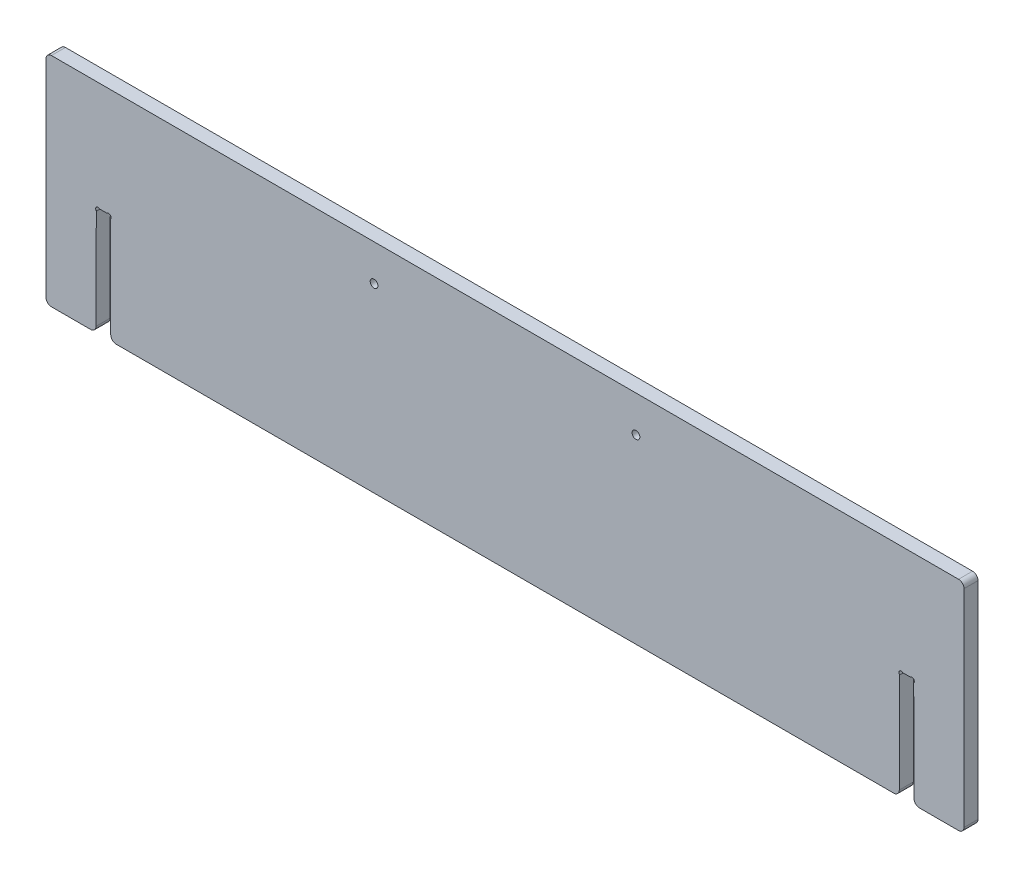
from build123d import *

# Parameters (mm, degrees)
ESQUISSE1_W         = 590.5
ESQUISSE1_H         = 280
BOSS_EXTRUDE1_DEPTH = 18
CUT_EXTRUDE1_DEPTH  = 654.769263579
ESQUISSE3_R         = 5
CUT_EXTRUDE2_DEPTH  = 654.769263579
CONG_1_R            = 7


with BuildPart() as part:
    # Esquisse1 → Boss-Extrude1 (new body)
    with BuildSketch(Plane.XY):
        with Locations((295.25, 140)):
            Rectangle(ESQUISSE1_W, ESQUISSE1_H)
    extrude(amount=BOSS_EXTRUDE1_DEPTH)

    # Esquisse2 → Cut-Extrude1 (cut, through all)
    with BuildSketch(Plane.XY.offset(18)):
        with BuildLine():
            Line((69.477649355, 140), (78.147350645, 140))
            ThreePointArc((78.147350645, 140), (78.480108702, 140.056987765), (78.774940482, 140.221455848))
            ThreePointArc((78.774940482, 140.221455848), (82.906692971, 140.005791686), (83.14421642, 135.875238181))
            ThreePointArc((83.14421642, 135.875238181), (82.981710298, 135.580689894), (82.926074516, 135.248919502))
            Line((82.926074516, 135.248919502), (83.3125, 0))
            Line((83.3125, 0), (64.3125, 0))
            Line((64.3125, 0), (64.698925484, 135.248919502))
            ThreePointArc((64.698925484, 135.248919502), (64.643289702, 135.580689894), (64.48078358, 135.875238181))
            ThreePointArc((64.48078358, 135.875238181), (64.718307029, 140.005791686), (68.850059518, 140.221455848))
            ThreePointArc((68.850059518, 140.221455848), (69.144891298, 140.056987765), (69.477649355, 140))
        make_face()
    extrude(amount=-CUT_EXTRUDE1_DEPTH, mode=Mode.SUBTRACT)

    # Esquisse3 → Cut-Extrude2 (cut, through all)
    with BuildSketch(Plane.XY.offset(18)):
        with Locations((422.0625, 233.333333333)):
            Circle(ESQUISSE3_R)
    extrude(amount=-CUT_EXTRUDE2_DEPTH, mode=Mode.SUBTRACT)

    # Cong_1
    cong_1_edges = [part.edges().sort_by_distance(p)[0] for p in [
        (83.3125, 0, 9),
        (64.3125, 0, 9),
        (0, 280, 9),
        (0, 0, 9),
    ]]
    fillet(cong_1_edges, radius=CONG_1_R)

    # Sym_trie1: part across plane


with BuildPart() as part_1:
    add(part.part)
    add(part.part.mirror(Plane(origin=(590.5, 0, 18), x_dir=(0, 0, 1), z_dir=(-1, 0, 0))))


solid = part_1.part
